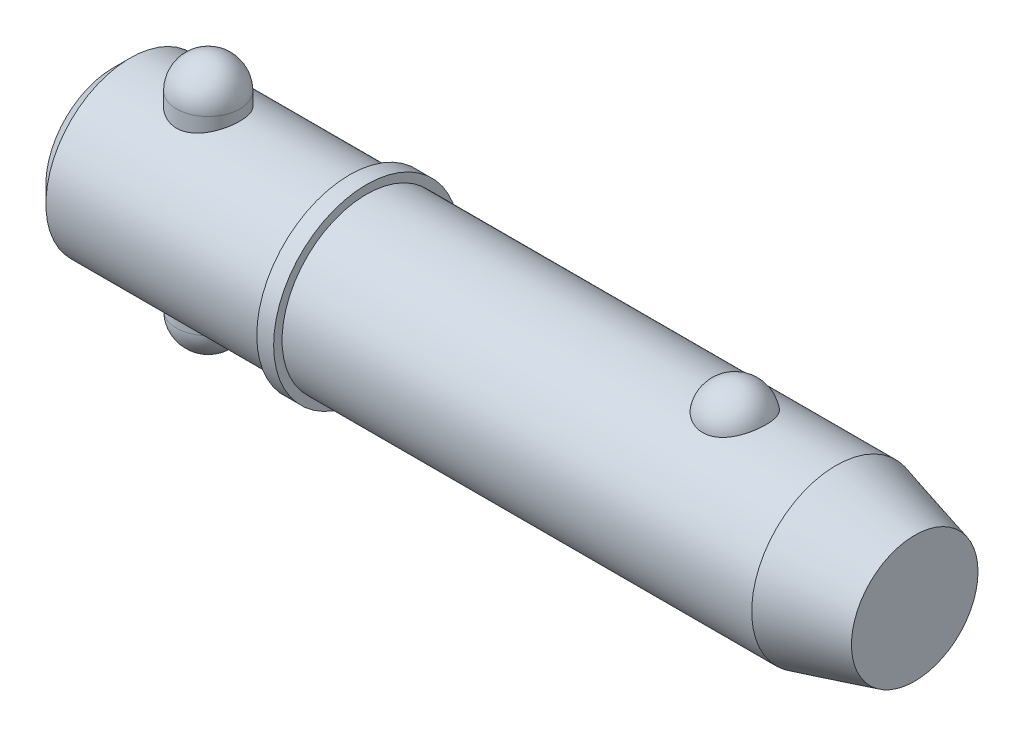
ISO-10303-21;
HEADER;
FILE_DESCRIPTION(('STEP AP214'),'2;1');
FILE_NAME('part.step','',(''),(''),'','','');
FILE_SCHEMA(('AUTOMOTIVE_DESIGN { 1 0 10303 214 1 1 1 1 }'));
ENDSEC;
DATA;
#1=APPLICATION_CONTEXT('core data for automotive mechanical design processes');
#2=APPLICATION_PROTOCOL_DEFINITION('international standard','automotive_design',2000,#1);
#3=PRODUCT_CONTEXT('',#1,'mechanical');
#4=PRODUCT('Part','Part','',(#3));
#5=PRODUCT_RELATED_PRODUCT_CATEGORY('part','',(#4));
#6=PRODUCT_DEFINITION_FORMATION('','',#4);
#7=PRODUCT_DEFINITION_CONTEXT('part definition',#1,'design');
#8=PRODUCT_DEFINITION('design','',#6,#7);
#9=PRODUCT_DEFINITION_SHAPE('','',#8);
#10=(LENGTH_UNIT() NAMED_UNIT(*) SI_UNIT(.MILLI.,.METRE.));
#11=(NAMED_UNIT(*) PLANE_ANGLE_UNIT() SI_UNIT($,.RADIAN.));
#12=(NAMED_UNIT(*) SI_UNIT($,.STERADIAN.) SOLID_ANGLE_UNIT());
#13=UNCERTAINTY_MEASURE_WITH_UNIT(LENGTH_MEASURE(1.E-05),#10,'distance_accuracy_value','');
#14=(GEOMETRIC_REPRESENTATION_CONTEXT(3) GLOBAL_UNCERTAINTY_ASSIGNED_CONTEXT((#13)) GLOBAL_UNIT_ASSIGNED_CONTEXT((#10,
#11,#12)) REPRESENTATION_CONTEXT('',''));
#15=CARTESIAN_POINT('',(0.,0.,0.));
#16=DIRECTION('',(0.,0.,1.));
#17=DIRECTION('',(1.,0.,0.));
#18=AXIS2_PLACEMENT_3D('',#15,#16,#17);
#19=CARTESIAN_POINT('',(14.28,19.05,0.));
#20=DIRECTION('',(0.,-1.,0.));
#21=DIRECTION('',(0.,0.,-1.));
#22=AXIS2_PLACEMENT_3D('',#19,#20,#21);
#23=CYLINDRICAL_SURFACE('',#22,4.76);
#24=CARTESIAN_POINT('',(14.28,-14.29,0.));
#25=DIRECTION('',(0.,-1.,0.));
#26=DIRECTION('',(0.,0.,-1.));
#27=AXIS2_PLACEMENT_3D('',#24,#25,#26);
#28=CIRCLE('',#27,4.76);
#29=CARTESIAN_POINT('',(14.28,-14.29,-4.76));
#30=VERTEX_POINT('',#29);
#31=EDGE_CURVE('P0_E10',#30,#30,#28,.F.);
#32=CARTESIAN_POINT('',(14.28,14.29,0.));
#33=DIRECTION('',(0.,-1.,0.));
#34=DIRECTION('',(0.,0.,-1.));
#35=AXIS2_PLACEMENT_3D('',#32,#33,#34);
#36=CIRCLE('',#35,4.76);
#37=CARTESIAN_POINT('',(14.28,14.29,-4.76));
#38=VERTEX_POINT('',#37);
#39=EDGE_CURVE('P0_E21',#38,#38,#36,.T.);
#40=CARTESIAN_POINT('',(14.28,-14.29,-4.76));
#41=CARTESIAN_POINT('',(14.28,-13.9922916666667,-4.76));
#42=CARTESIAN_POINT('',(14.28,-13.6945833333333,-4.76));
#43=CARTESIAN_POINT('',(14.28,-13.0991666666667,-4.76));
#44=CARTESIAN_POINT('',(14.28,-12.8014583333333,-4.76));
#45=CARTESIAN_POINT('',(14.28,-12.2060416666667,-4.76));
#46=CARTESIAN_POINT('',(14.28,-11.9083333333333,-4.76));
#47=CARTESIAN_POINT('',(14.28,-11.3129166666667,-4.76));
#48=CARTESIAN_POINT('',(14.28,-11.0152083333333,-4.76));
#49=CARTESIAN_POINT('',(14.28,-10.4197916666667,-4.76));
#50=CARTESIAN_POINT('',(14.28,-10.1220833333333,-4.76));
#51=CARTESIAN_POINT('',(14.28,-9.52666666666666,-4.76));
#52=CARTESIAN_POINT('',(14.28,-9.22895833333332,-4.76));
#53=CARTESIAN_POINT('',(14.28,-8.63354166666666,-4.76));
#54=CARTESIAN_POINT('',(14.28,-8.33583333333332,-4.76));
#55=CARTESIAN_POINT('',(14.28,-7.74041666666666,-4.76));
#56=CARTESIAN_POINT('',(14.28,-7.44270833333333,-4.76));
#57=CARTESIAN_POINT('',(14.28,-6.84729166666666,-4.76));
#58=CARTESIAN_POINT('',(14.28,-6.54958333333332,-4.76));
#59=CARTESIAN_POINT('',(14.28,-5.95416666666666,-4.76));
#60=CARTESIAN_POINT('',(14.28,-5.65645833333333,-4.76));
#61=CARTESIAN_POINT('',(14.28,-5.06104166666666,-4.76));
#62=CARTESIAN_POINT('',(14.28,-4.76333333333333,-4.76));
#63=CARTESIAN_POINT('',(14.28,-4.16791666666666,-4.76));
#64=CARTESIAN_POINT('',(14.28,-3.87020833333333,-4.76));
#65=CARTESIAN_POINT('',(14.28,-3.27479166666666,-4.76));
#66=CARTESIAN_POINT('',(14.28,-2.97708333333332,-4.76));
#67=CARTESIAN_POINT('',(14.28,-2.38166666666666,-4.76));
#68=CARTESIAN_POINT('',(14.28,-2.08395833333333,-4.76));
#69=CARTESIAN_POINT('',(14.28,-1.48854166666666,-4.76));
#70=CARTESIAN_POINT('',(14.28,-1.19083333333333,-4.76));
#71=CARTESIAN_POINT('',(14.28,-0.595416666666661,-4.76));
#72=CARTESIAN_POINT('',(14.28,-0.297708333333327,-4.76));
#73=CARTESIAN_POINT('',(14.28,0.297708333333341,-4.76));
#74=CARTESIAN_POINT('',(14.28,0.595416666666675,-4.76));
#75=CARTESIAN_POINT('',(14.28,1.19083333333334,-4.76));
#76=CARTESIAN_POINT('',(14.28,1.48854166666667,-4.76));
#77=CARTESIAN_POINT('',(14.28,2.08395833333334,-4.76));
#78=CARTESIAN_POINT('',(14.28,2.38166666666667,-4.76));
#79=CARTESIAN_POINT('',(14.28,2.97708333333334,-4.76));
#80=CARTESIAN_POINT('',(14.28,3.27479166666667,-4.76));
#81=CARTESIAN_POINT('',(14.28,3.87020833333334,-4.76));
#82=CARTESIAN_POINT('',(14.28,4.16791666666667,-4.76));
#83=CARTESIAN_POINT('',(14.28,4.76333333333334,-4.76));
#84=CARTESIAN_POINT('',(14.28,5.06104166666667,-4.76));
#85=CARTESIAN_POINT('',(14.28,5.65645833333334,-4.76));
#86=CARTESIAN_POINT('',(14.28,5.95416666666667,-4.76));
#87=CARTESIAN_POINT('',(14.28,6.54958333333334,-4.76));
#88=CARTESIAN_POINT('',(14.28,6.84729166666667,-4.76));
#89=CARTESIAN_POINT('',(14.28,7.44270833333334,-4.76));
#90=CARTESIAN_POINT('',(14.28,7.74041666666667,-4.76));
#91=CARTESIAN_POINT('',(14.28,8.33583333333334,-4.76));
#92=CARTESIAN_POINT('',(14.28,8.63354166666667,-4.76));
#93=CARTESIAN_POINT('',(14.28,9.22895833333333,-4.76));
#94=CARTESIAN_POINT('',(14.28,9.52666666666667,-4.76));
#95=CARTESIAN_POINT('',(14.28,10.1220833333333,-4.76));
#96=CARTESIAN_POINT('',(14.28,10.4197916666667,-4.76));
#97=CARTESIAN_POINT('',(14.28,11.0152083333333,-4.76));
#98=CARTESIAN_POINT('',(14.28,11.3129166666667,-4.76));
#99=CARTESIAN_POINT('',(14.28,11.9083333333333,-4.76));
#100=CARTESIAN_POINT('',(14.28,12.2060416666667,-4.76));
#101=CARTESIAN_POINT('',(14.28,12.8014583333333,-4.76));
#102=CARTESIAN_POINT('',(14.28,13.0991666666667,-4.76));
#103=CARTESIAN_POINT('',(14.28,13.6945833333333,-4.76));
#104=CARTESIAN_POINT('',(14.28,13.9922916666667,-4.76));
#105=CARTESIAN_POINT('',(14.28,14.29,-4.76));
#106=B_SPLINE_CURVE_WITH_KNOTS('',3,(#40,#41,#42,#43,#44,#45,#46,#47,#48,#49,#50,#51,#52,#53,
#54,#55,#56,#57,#58,#59,#60,#61,#62,#63,#64,#65,#66,#67,#68,#69,#70,#71,#72,#73,#74,#75,#76,#77,
#78,#79,#80,#81,#82,#83,#84,#85,#86,#87,#88,#89,#90,#91,#92,#93,#94,#95,#96,#97,#98,#99,#100,
#101,#102,#103,#104,#105),.UNSPECIFIED.,.F.,.F.,(4,2,2,2,2,2,2,2,2,2,2,2,2,2,2,2,2,2,2,2,2,2,2,
2,2,2,2,2,2,2,2,2,4),(0.,0.893125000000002,1.78625,2.67937499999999,3.5725,4.465625,5.35875,
6.25187499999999,7.145,8.038125,8.93125,9.82437499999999,10.7175,11.610625,12.50375,13.396875,
14.29,15.183125,16.07625,16.969375,17.8625,18.755625,19.64875,20.541875,21.435,22.328125,
23.22125,24.114375,25.0075,25.900625,26.79375,27.686875,28.58),.UNSPECIFIED.);
#107=EDGE_CURVE('P0_BSEAM14',#30,#38,#106,.T.);
#108=ORIENTED_EDGE('',*,*,#31,.T.);
#109=ORIENTED_EDGE('',*,*,#39,.T.);
#110=ORIENTED_EDGE('',*,*,#107,.T.);
#111=ORIENTED_EDGE('',*,*,#107,.F.);
#112=EDGE_LOOP('',(#108,#110,#109,#111));
#113=FACE_BOUND('',#112,.T.);
#114=ADVANCED_FACE('P0_F14',(#113),#23,.T.);
#115=CARTESIAN_POINT('',(14.28,-14.29,0.));
#116=DIRECTION('',(0.,0.,1.));
#117=DIRECTION('',(1.,0.,0.));
#118=AXIS2_PLACEMENT_3D('',#115,#116,#117);
#119=SPHERICAL_SURFACE('',#118,4.76);
#120=CARTESIAN_POINT('',(14.28,-14.29,0.));
#121=DIRECTION('',(0.,-1.,0.));
#122=DIRECTION('',(0.,0.,-1.));
#123=AXIS2_PLACEMENT_3D('',#120,#121,#122);
#124=SPHERICAL_SURFACE('',#123,4.76);
#125=ORIENTED_EDGE('',*,*,#31,.F.);
#126=EDGE_LOOP('',(#125));
#127=FACE_BOUND('',#126,.T.);
#128=ADVANCED_FACE('P0_F29',(#127),#124,.T.);
#129=CARTESIAN_POINT('',(14.28,14.29,0.));
#130=DIRECTION('',(0.,0.,1.));
#131=DIRECTION('',(1.,0.,0.));
#132=AXIS2_PLACEMENT_3D('',#129,#130,#131);
#133=SPHERICAL_SURFACE('',#132,4.76);
#134=CARTESIAN_POINT('',(14.28,14.29,0.));
#135=DIRECTION('',(0.,-1.,0.));
#136=DIRECTION('',(0.,0.,-1.));
#137=AXIS2_PLACEMENT_3D('',#134,#135,#136);
#138=SPHERICAL_SURFACE('',#137,4.76);
#139=ORIENTED_EDGE('',*,*,#39,.F.);
#140=EDGE_LOOP('',(#139));
#141=FACE_BOUND('',#140,.T.);
#142=ADVANCED_FACE('P0_F16',(#141),#138,.T.);
#143=CLOSED_SHELL('',(#114,#128,#142));
#144=MANIFOLD_SOLID_BREP('P0_B1',#143);
#145=CARTESIAN_POINT('',(0.,0.,0.));
#146=DIRECTION('',(1.,0.,0.));
#147=DIRECTION('',(0.,0.,-1.));
#148=AXIS2_PLACEMENT_3D('',#145,#146,#147);
#149=CYLINDRICAL_SURFACE('',#148,12.7);
#150=CARTESIAN_POINT('',(108.800738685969,0.,0.));
#151=DIRECTION('',(1.,0.,0.));
#152=DIRECTION('',(0.,0.,-1.));
#153=AXIS2_PLACEMENT_3D('',#150,#151,#152);
#154=CIRCLE('',#153,12.7);
#155=CARTESIAN_POINT('',(108.800738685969,0.,-12.7));
#156=VERTEX_POINT('',#155);
#157=EDGE_CURVE('P1_E81',#156,#156,#154,.T.);
#158=ORIENTED_EDGE('',*,*,#157,.F.);
#159=EDGE_LOOP('',(#158));
#160=FACE_BOUND('',#159,.T.);
#161=CARTESIAN_POINT('',(38.1,0.,0.));
#162=DIRECTION('',(1.,0.,0.));
#163=DIRECTION('',(0.,0.,-1.));
#164=AXIS2_PLACEMENT_3D('',#161,#162,#163);
#165=CIRCLE('',#164,12.7);
#166=CARTESIAN_POINT('',(38.1,0.,-12.7));
#167=VERTEX_POINT('',#166);
#168=EDGE_CURVE('P1_E85',#167,#167,#165,.T.);
#169=ORIENTED_EDGE('',*,*,#168,.T.);
#170=EDGE_LOOP('',(#169));
#171=FACE_BOUND('',#170,.T.);
#172=CARTESIAN_POINT('',(93.5600429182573,11.7500437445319,4.81938502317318));
#173=CARTESIAN_POINT('',(93.4350881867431,11.7500430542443,4.81938571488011));
#174=CARTESIAN_POINT('',(93.310144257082,11.7520975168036,4.81438658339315));
#175=CARTESIAN_POINT('',(93.0611425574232,11.760253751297,4.79442904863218));
#176=CARTESIAN_POINT('',(92.9370850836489,11.7663568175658,4.77946746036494));
#177=CARTESIAN_POINT('',(92.6909016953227,11.7824262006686,4.7397141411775));
#178=CARTESIAN_POINT('',(92.5687744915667,11.7923898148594,4.71492928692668));
#179=CARTESIAN_POINT('',(92.3271874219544,11.8158938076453,4.65571340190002));
#180=CARTESIAN_POINT('',(92.2077285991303,11.8294355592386,4.6212786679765));
#181=CARTESIAN_POINT('',(91.9725578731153,11.8596812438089,4.54309502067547));
#182=CARTESIAN_POINT('',(91.8568393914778,11.8763792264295,4.49936361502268));
#183=CARTESIAN_POINT('',(91.6296530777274,11.9124878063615,4.40287235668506));
#184=CARTESIAN_POINT('',(91.5181868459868,11.9318994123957,4.35010914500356));
#185=CARTESIAN_POINT('',(91.1912782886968,11.9934256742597,4.17881316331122));
#186=CARTESIAN_POINT('',(90.9831270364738,12.038858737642,4.04720756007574));
#187=CARTESIAN_POINT('',(90.5858509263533,12.1352173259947,3.748564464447));
#188=CARTESIAN_POINT('',(90.3974438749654,12.1862630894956,3.58061821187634));
#189=CARTESIAN_POINT('',(90.0505213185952,12.2875163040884,3.21600758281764));
#190=CARTESIAN_POINT('',(89.8920113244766,12.3377235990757,3.0193379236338));
#191=CARTESIAN_POINT('',(89.6016887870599,12.434492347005,2.592916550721));
#192=CARTESIAN_POINT('',(89.4713762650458,12.4807925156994,2.36208286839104));
#193=CARTESIAN_POINT('',(89.2494079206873,12.5623454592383,1.88070399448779));
#194=CARTESIAN_POINT('',(89.1577554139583,12.5975972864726,1.63015711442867));
#195=CARTESIAN_POINT('',(89.0140466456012,12.6538414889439,1.1129886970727));
#196=CARTESIAN_POINT('',(88.9624990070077,12.6746503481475,0.846205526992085));
#197=CARTESIAN_POINT('',(88.9019771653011,12.699153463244,0.307085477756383));
#198=CARTESIAN_POINT('',(88.8930018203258,12.7028481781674,0.0347487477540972));
#199=CARTESIAN_POINT('',(88.9177310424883,12.6927785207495,-0.506073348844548));
#200=CARTESIAN_POINT('',(88.9511899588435,12.6791146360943,-0.77457186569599));
#201=CARTESIAN_POINT('',(89.0596877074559,12.635882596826,-1.30170246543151));
#202=CARTESIAN_POINT('',(89.1347272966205,12.606314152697,-1.5603343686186));
#203=CARTESIAN_POINT('',(89.3250000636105,12.5342328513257,-2.06083899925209));
#204=CARTESIAN_POINT('',(89.4402872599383,12.4917026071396,-2.3026886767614));
#205=CARTESIAN_POINT('',(89.7087044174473,12.3981123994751,-2.76259600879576));
#206=CARTESIAN_POINT('',(89.8618374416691,12.3470517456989,-2.98065173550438));
#207=CARTESIAN_POINT('',(90.2035077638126,12.2416045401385,-3.38786328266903));
#208=CARTESIAN_POINT('',(90.3922017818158,12.1872040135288,-3.57688418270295));
#209=CARTESIAN_POINT('',(90.8002392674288,12.0814086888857,-3.91941073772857));
#210=CARTESIAN_POINT('',(91.0195800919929,12.0300136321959,-4.07291945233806));
#211=CARTESIAN_POINT('',(91.4783753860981,11.9373542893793,-4.33691289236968));
#212=CARTESIAN_POINT('',(91.7173044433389,11.8958982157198,-4.44824125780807));
#213=CARTESIAN_POINT('',(92.2124376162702,11.8268116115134,-4.62881985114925));
#214=CARTESIAN_POINT('',(92.4686351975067,11.7991758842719,-4.69808589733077));
#215=CARTESIAN_POINT('',(92.9771640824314,11.7622209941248,-4.78983181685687));
#216=CARTESIAN_POINT('',(93.2290414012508,11.7520502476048,-4.81449025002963));
#217=CARTESIAN_POINT('',(93.7335734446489,11.7485796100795,-4.82295735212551));
#218=CARTESIAN_POINT('',(93.9862280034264,11.7552763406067,-4.80677420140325));
#219=CARTESIAN_POINT('',(94.4768341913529,11.7842584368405,-4.73525430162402));
#220=CARTESIAN_POINT('',(94.7149984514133,11.8060486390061,-4.68116061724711));
#221=CARTESIAN_POINT('',(95.1784894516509,11.8622750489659,-4.53678133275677));
#222=CARTESIAN_POINT('',(95.4038151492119,11.8967122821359,-4.44649279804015));
#223=CARTESIAN_POINT('',(95.8408018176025,11.9754603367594,-4.2298761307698));
#224=CARTESIAN_POINT('',(96.0520579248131,12.0199699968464,-4.10280539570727));
#225=CARTESIAN_POINT('',(96.4506012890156,12.1138028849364,-3.81685409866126));
#226=CARTESIAN_POINT('',(96.6378830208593,12.163127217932,-3.65796622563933));
#227=CARTESIAN_POINT('',(96.9933509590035,12.2642343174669,-3.30364864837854));
#228=CARTESIAN_POINT('',(97.1601119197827,12.3160165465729,-3.10678783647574));
#229=CARTESIAN_POINT('',(97.4595799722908,12.4142566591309,-2.68748409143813));
#230=CARTESIAN_POINT('',(97.5922809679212,12.4607135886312,-2.46503658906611));
#231=CARTESIAN_POINT('',(97.8246912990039,12.5450236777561,-1.99289519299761));
#232=CARTESIAN_POINT('',(97.923215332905,12.5825557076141,-1.74255918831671));
#233=CARTESIAN_POINT('',(98.0792277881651,12.6431720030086,-1.22773734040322));
#234=CARTESIAN_POINT('',(98.1367157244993,12.6662560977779,-0.963251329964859));
#235=CARTESIAN_POINT('',(98.2095441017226,12.6956486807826,-0.427355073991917));
#236=CARTESIAN_POINT('',(98.2248378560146,12.7019385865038,-0.1559374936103));
#237=CARTESIAN_POINT('',(98.2127794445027,12.6970201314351,0.385928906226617));
#238=CARTESIAN_POINT('',(98.1854280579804,12.6858120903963,0.656377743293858));
#239=CARTESIAN_POINT('',(98.1130609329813,12.6568455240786,1.05454017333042));
#240=CARTESIAN_POINT('',(98.0837963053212,12.6451962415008,1.18577850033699));
#241=CARTESIAN_POINT('',(98.0150228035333,12.6181819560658,1.4451380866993));
#242=CARTESIAN_POINT('',(97.9755176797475,12.6028183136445,1.57326046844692));
#243=CARTESIAN_POINT('',(97.8864397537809,12.5687547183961,1.82554978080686));
#244=CARTESIAN_POINT('',(97.8368627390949,12.5500533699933,1.9497150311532));
#245=CARTESIAN_POINT('',(97.7279211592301,12.5098093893,2.1931437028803));
#246=CARTESIAN_POINT('',(97.6685601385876,12.4882677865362,2.31240887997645));
#247=CARTESIAN_POINT('',(97.5399712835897,12.4427679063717,2.54593031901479));
#248=CARTESIAN_POINT('',(97.4706888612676,12.4187964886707,2.66015396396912));
#249=CARTESIAN_POINT('',(97.322903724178,12.3691892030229,2.88202659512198));
#250=CARTESIAN_POINT('',(97.2444044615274,12.3435539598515,2.98967802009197));
#251=CARTESIAN_POINT('',(97.0785502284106,12.2912955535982,3.19774385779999));
#252=CARTESIAN_POINT('',(96.9911918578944,12.2646720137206,3.29815546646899));
#253=CARTESIAN_POINT('',(96.8081617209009,12.2111945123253,3.49095035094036));
#254=CARTESIAN_POINT('',(96.7124932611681,12.1843406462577,3.58333679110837));
#255=CARTESIAN_POINT('',(96.5136272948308,12.1312249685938,3.75922876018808));
#256=CARTESIAN_POINT('',(96.4104503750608,12.104961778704,3.84275713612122));
#257=CARTESIAN_POINT('',(96.1970133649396,12.0537284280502,4.00056406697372));
#258=CARTESIAN_POINT('',(96.0867562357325,12.028757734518,4.07484645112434));
#259=CARTESIAN_POINT('',(95.8597550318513,11.9808306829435,4.21367959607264));
#260=CARTESIAN_POINT('',(95.7430068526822,11.9578756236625,4.27822410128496));
#261=CARTESIAN_POINT('',(95.5039425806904,11.9147184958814,4.39698483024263));
#262=CARTESIAN_POINT('',(95.3816287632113,11.894515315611,4.45120522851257));
#263=CARTESIAN_POINT('',(95.122952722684,11.8561129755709,4.55255353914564));
#264=CARTESIAN_POINT('',(94.9862237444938,11.8381764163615,4.59884858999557));
#265=CARTESIAN_POINT('',(94.7086087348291,11.8069093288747,4.67853897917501));
#266=CARTESIAN_POINT('',(94.5677245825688,11.7935767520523,4.71194005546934));
#267=CARTESIAN_POINT('',(94.2830944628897,11.7720277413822,4.76552188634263));
#268=CARTESIAN_POINT('',(94.1393488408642,11.7638106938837,4.78570422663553));
#269=CARTESIAN_POINT('',(93.8504114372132,11.7528195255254,4.81263433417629));
#270=CARTESIAN_POINT('',(93.7052198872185,11.7500445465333,4.81938421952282));
#271=CARTESIAN_POINT('',(93.5600429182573,11.7500437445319,4.81938502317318));
#272=B_SPLINE_CURVE_WITH_KNOTS('',3,(#172,#173,#174,#175,#176,#177,#178,#179,#180,#181,#182,
#183,#184,#185,#186,#187,#188,#189,#190,#191,#192,#193,#194,#195,#196,#197,#198,#199,#200,#201,
#202,#203,#204,#205,#206,#207,#208,#209,#210,#211,#212,#213,#214,#215,#216,#217,#218,#219,#220,
#221,#222,#223,#224,#225,#226,#227,#228,#229,#230,#231,#232,#233,#234,#235,#236,#237,#238,#239,
#240,#241,#242,#243,#244,#245,#246,#247,#248,#249,#250,#251,#252,#253,#254,#255,#256,#257,#258,
#259,#260,#261,#262,#263,#264,#265,#266,#267,#268,#269,#270,#271),.UNSPECIFIED.,.T.,.F.,(4,2,2,
2,2,2,2,2,2,2,2,2,2,2,2,2,2,2,2,2,2,2,2,2,2,2,2,2,2,2,2,2,2,2,2,2,2,2,2,2,2,2,2,2,2,2,2,2,2,4),
(0.,0.374729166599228,0.749578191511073,1.12416526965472,1.49889629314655,1.87292776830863,
2.24709865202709,2.99481328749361,3.76399449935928,4.53331735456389,5.3368391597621,
6.14042986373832,6.95405296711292,7.76765424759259,8.57656703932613,9.38549455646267,
10.1955119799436,11.0055949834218,11.8193353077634,12.6330054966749,13.4294141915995,
14.2255231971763,14.9815786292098,15.7374826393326,16.4696948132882,17.2019663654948,
17.9501979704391,18.6986017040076,19.484470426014,20.2704797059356,21.0815215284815,
21.8925729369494,22.7045213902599,23.5164550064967,23.9209608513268,24.3253187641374,
24.7298461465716,25.1342272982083,25.54092555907,25.9474719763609,26.3541750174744,
26.7607169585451,27.1661834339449,27.5714814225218,27.9770386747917,28.3824315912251,
28.8181206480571,29.2536155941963,29.6890582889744,30.1244323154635),.UNSPECIFIED.);
#273=CARTESIAN_POINT('',(93.5600429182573,11.7500437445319,4.81938502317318));
#274=VERTEX_POINT('',#273);
#275=EDGE_CURVE('P1_E35',#274,#274,#272,.T.);
#276=ORIENTED_EDGE('',*,*,#275,.T.);
#277=EDGE_LOOP('',(#276));
#278=FACE_BOUND('',#277,.T.);
#279=ADVANCED_FACE('P1_F13',(#160,#171,#278),#149,.T.);
#280=CARTESIAN_POINT('',(0.,0.,0.));
#281=DIRECTION('',(-1.,0.,0.));
#282=DIRECTION('',(0.,0.,1.));
#283=AXIS2_PLACEMENT_3D('',#280,#281,#282);
#284=PLANE('',#283);
#285=CARTESIAN_POINT('',(0.,0.,0.));
#286=DIRECTION('',(1.,0.,0.));
#287=DIRECTION('',(0.,0.,-1.));
#288=AXIS2_PLACEMENT_3D('',#285,#286,#287);
#289=CIRCLE('',#288,10.16);
#290=CARTESIAN_POINT('',(0.,0.,-10.16));
#291=VERTEX_POINT('',#290);
#292=EDGE_CURVE('P1_E9',#291,#291,#289,.T.);
#293=ORIENTED_EDGE('',*,*,#292,.F.);
#294=EDGE_LOOP('',(#293));
#295=FACE_BOUND('',#294,.T.);
#296=ADVANCED_FACE('P1_F15',(#295),#284,.T.);
#297=CARTESIAN_POINT('',(2.53999999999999,0.,0.));
#298=DIRECTION('',(1.,0.,0.));
#299=DIRECTION('',(0.,0.,-1.));
#300=AXIS2_PLACEMENT_3D('',#297,#298,#299);
#301=CONICAL_SURFACE('',#300,12.7,0.78539816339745);
#302=ORIENTED_EDGE('',*,*,#292,.T.);
#303=EDGE_LOOP('',(#302));
#304=FACE_BOUND('',#303,.T.);
#305=CARTESIAN_POINT('',(2.53999999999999,0.,0.));
#306=DIRECTION('',(1.,0.,0.));
#307=DIRECTION('',(0.,0.,-1.));
#308=AXIS2_PLACEMENT_3D('',#305,#306,#307);
#309=CIRCLE('',#308,12.7);
#310=CARTESIAN_POINT('',(2.53999999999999,0.,-12.7));
#311=VERTEX_POINT('',#310);
#312=EDGE_CURVE('P1_E26',#311,#311,#309,.T.);
#313=ORIENTED_EDGE('',*,*,#312,.F.);
#314=EDGE_LOOP('',(#313));
#315=FACE_BOUND('',#314,.T.);
#316=ADVANCED_FACE('P1_F77',(#304,#315),#301,.T.);
#317=CARTESIAN_POINT('',(0.,0.,0.));
#318=DIRECTION('',(1.,0.,0.));
#319=DIRECTION('',(0.,0.,-1.));
#320=AXIS2_PLACEMENT_3D('',#317,#318,#319);
#321=CYLINDRICAL_SURFACE('',#320,12.7);
#322=CARTESIAN_POINT('',(14.28,-11.7742260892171,4.76));
#323=CARTESIAN_POINT('',(14.1514948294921,-11.7742255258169,4.76000061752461));
#324=CARTESIAN_POINT('',(14.0229980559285,-11.7763355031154,4.75479194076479));
#325=CARTESIAN_POINT('',(13.7669369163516,-11.7847043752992,4.73401198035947));
#326=CARTESIAN_POINT('',(13.6393728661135,-11.7909646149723,4.71843733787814));
#327=CARTESIAN_POINT('',(13.386226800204,-11.8074248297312,4.67709434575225));
#328=CARTESIAN_POINT('',(13.2606439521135,-11.8176231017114,4.65133040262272));
#329=CARTESIAN_POINT('',(13.0122434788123,-11.8416347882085,4.58985545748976));
#330=CARTESIAN_POINT('',(12.8894269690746,-11.8554496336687,4.55414051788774));
#331=CARTESIAN_POINT('',(12.6477622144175,-11.8862222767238,4.47320764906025));
#332=CARTESIAN_POINT('',(12.5289037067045,-11.9031710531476,4.4280169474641));
#333=CARTESIAN_POINT('',(12.2955059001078,-11.939736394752,4.32845291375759));
#334=CARTESIAN_POINT('',(12.1809682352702,-11.9593539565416,4.2740761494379));
#335=CARTESIAN_POINT('',(11.8448901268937,-12.0213893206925,4.09777237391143));
#336=CARTESIAN_POINT('',(11.6307077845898,-12.0670135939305,3.9626122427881));
#337=CARTESIAN_POINT('',(11.2179129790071,-12.1641514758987,3.65386230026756));
#338=CARTESIAN_POINT('',(11.0204399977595,-12.2158379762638,3.47881300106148));
#339=CARTESIAN_POINT('',(10.6568212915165,-12.3178468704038,3.09829182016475));
#340=CARTESIAN_POINT('',(10.4906822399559,-12.3681689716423,2.89281347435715));
#341=CARTESIAN_POINT('',(10.1890299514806,-12.4638367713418,2.44867909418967));
#342=CARTESIAN_POINT('',(10.054749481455,-12.5089552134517,2.20913281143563));
#343=CARTESIAN_POINT('',(9.82886079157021,-12.5870472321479,1.70885919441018));
#344=CARTESIAN_POINT('',(9.73723778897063,-12.620025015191,1.44813923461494));
#345=CARTESIAN_POINT('',(9.60324488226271,-12.6688874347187,0.9248423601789));
#346=CARTESIAN_POINT('',(9.55892269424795,-12.6854474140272,0.662829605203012));
#347=CARTESIAN_POINT('',(9.5145335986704,-12.7020320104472,0.134596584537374));
#348=CARTESIAN_POINT('',(9.5144523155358,-12.7020619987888,-0.131622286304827));
#349=CARTESIAN_POINT('',(9.55741019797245,-12.6860129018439,-0.646717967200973));
#350=CARTESIAN_POINT('',(9.59831845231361,-12.6707298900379,-0.895801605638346));
#351=CARTESIAN_POINT('',(9.71850987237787,-12.6268158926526,-1.38327219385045));
#352=CARTESIAN_POINT('',(9.79779575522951,-12.5981839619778,-1.62165838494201));
#353=CARTESIAN_POINT('',(9.99348296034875,-12.5298894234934,-2.08508424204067));
#354=CARTESIAN_POINT('',(10.110407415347,-12.4900724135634,-2.30987931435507));
#355=CARTESIAN_POINT('',(10.3775896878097,-12.4034373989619,-2.7372158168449));
#356=CARTESIAN_POINT('',(10.5278582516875,-12.3566171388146,-2.93975004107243));
#357=CARTESIAN_POINT('',(10.8677318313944,-12.257571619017,-3.32936830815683));
#358=CARTESIAN_POINT('',(11.0591227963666,-12.2051903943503,-3.51485714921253));
#359=CARTESIAN_POINT('',(11.4706087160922,-12.1031155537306,-3.85170663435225));
#360=CARTESIAN_POINT('',(11.6907108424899,-12.0534226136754,-4.00305872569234));
#361=CARTESIAN_POINT('',(12.1596597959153,-11.9613684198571,-4.27038218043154));
#362=CARTESIAN_POINT('',(12.4090353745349,-11.9191939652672,-4.38549550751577));
#363=CARTESIAN_POINT('',(12.9256290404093,-11.8491124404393,-4.57149117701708));
#364=CARTESIAN_POINT('',(13.1928371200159,-11.8211974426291,-4.64239810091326));
#365=CARTESIAN_POINT('',(13.7217488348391,-11.7846654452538,-4.73434137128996));
#366=CARTESIAN_POINT('',(13.9829438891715,-11.7750694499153,-4.75791141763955));
#367=CARTESIAN_POINT('',(14.5056760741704,-11.7734909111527,-4.76182097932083));
#368=CARTESIAN_POINT('',(14.7672131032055,-11.7815039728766,-4.74217128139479));
#369=CARTESIAN_POINT('',(15.2702140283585,-11.8132466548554,-4.66249544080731));
#370=CARTESIAN_POINT('',(15.5120417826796,-11.8362133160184,-4.60442726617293));
#371=CARTESIAN_POINT('',(15.9824097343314,-11.8943704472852,-4.45202868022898));
#372=CARTESIAN_POINT('',(16.2109472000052,-11.9295634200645,-4.35769084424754));
#373=CARTESIAN_POINT('',(16.6577741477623,-12.0098310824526,-4.13144368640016));
#374=CARTESIAN_POINT('',(16.8753590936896,-12.055226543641,-3.99825937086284));
#375=CARTESIAN_POINT('',(17.2859732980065,-12.150238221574,-3.69949845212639));
#376=CARTESIAN_POINT('',(17.4789935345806,-12.19985597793,-3.5339100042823));
#377=CARTESIAN_POINT('',(17.8477707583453,-12.3015434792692,-3.1624728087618));
#378=CARTESIAN_POINT('',(18.0216609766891,-12.3535695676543,-2.95473880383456));
#379=CARTESIAN_POINT('',(18.254545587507,-12.426745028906,-2.62277433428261));
#380=CARTESIAN_POINT('',(18.3275489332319,-12.4503382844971,-2.50865480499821));
#381=CARTESIAN_POINT('',(18.463723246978,-12.4952713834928,-2.27428971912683));
#382=CARTESIAN_POINT('',(18.5268984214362,-12.5166121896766,-2.15404681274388));
#383=CARTESIAN_POINT('',(18.6427140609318,-12.5563817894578,-1.90858448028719));
#384=CARTESIAN_POINT('',(18.6953855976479,-12.5748191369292,-1.78338108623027));
#385=CARTESIAN_POINT('',(18.7899337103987,-12.6083284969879,-1.52857834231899));
#386=CARTESIAN_POINT('',(18.8318147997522,-12.6234019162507,-1.39898085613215));
#387=CARTESIAN_POINT('',(18.9043819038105,-12.6497495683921,-1.13633254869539));
#388=CARTESIAN_POINT('',(18.9350698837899,-12.6610244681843,-1.00328233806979));
#389=CARTESIAN_POINT('',(18.9849303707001,-12.6794412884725,-0.734761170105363));
#390=CARTESIAN_POINT('',(19.0041035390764,-12.6865834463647,-0.59929035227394));
#391=CARTESIAN_POINT('',(19.0299427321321,-12.6962286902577,-0.335006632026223));
#392=CARTESIAN_POINT('',(19.0372742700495,-12.698978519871,-0.206267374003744));
#393=CARTESIAN_POINT('',(19.0414668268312,-12.7005496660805,0.0514515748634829));
#394=CARTESIAN_POINT('',(19.038324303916,-12.69936965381,0.180431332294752));
#395=CARTESIAN_POINT('',(19.0215965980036,-12.6931114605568,0.437551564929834));
#396=CARTESIAN_POINT('',(19.0080165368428,-12.6880351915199,0.565692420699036));
#397=CARTESIAN_POINT('',(18.9705519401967,-12.6741222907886,0.820297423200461));
#398=CARTESIAN_POINT('',(18.9466635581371,-12.665284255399,0.946760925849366));
#399=CARTESIAN_POINT('',(18.8895279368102,-12.6443449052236,1.19395899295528));
#400=CARTESIAN_POINT('',(18.8565273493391,-12.6323299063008,1.3147578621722));
#401=CARTESIAN_POINT('',(18.781239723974,-12.6052503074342,1.55308888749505));
#402=CARTESIAN_POINT('',(18.738949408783,-12.5901846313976,1.67061987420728));
#403=CARTESIAN_POINT('',(18.5986461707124,-12.5409473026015,2.01714406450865));
#404=CARTESIAN_POINT('',(18.4871532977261,-12.502717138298,2.24027279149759));
#405=CARTESIAN_POINT('',(18.2262440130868,-12.4173042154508,2.6742599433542));
#406=CARTESIAN_POINT('',(18.0754310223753,-12.3698127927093,2.88420891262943));
#407=CARTESIAN_POINT('',(17.7421836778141,-12.271667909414,3.27675114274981));
#408=CARTESIAN_POINT('',(17.5597380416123,-12.2210133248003,3.45933459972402));
#409=CARTESIAN_POINT('',(17.2605468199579,-12.1452079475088,3.7138066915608));
#410=CARTESIAN_POINT('',(17.1535518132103,-12.119328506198,3.79719993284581));
#411=CARTESIAN_POINT('',(16.9326449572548,-12.0688597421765,3.95467398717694));
#412=CARTESIAN_POINT('',(16.8187356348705,-12.0442699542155,4.02875817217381));
#413=CARTESIAN_POINT('',(16.5846234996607,-11.9971053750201,4.16711104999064));
#414=CARTESIAN_POINT('',(16.4644172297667,-11.9745317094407,4.23137427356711));
#415=CARTESIAN_POINT('',(16.2185866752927,-11.9321360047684,4.34949041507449));
#416=CARTESIAN_POINT('',(16.09296473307,-11.9123127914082,4.40334777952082));
#417=CARTESIAN_POINT('',(15.8314769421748,-11.875268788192,4.50232278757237));
#418=CARTESIAN_POINT('',(15.6954035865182,-11.8582009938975,4.54695127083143));
#419=CARTESIAN_POINT('',(15.4194002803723,-11.8284328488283,4.62383807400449));
#420=CARTESIAN_POINT('',(15.2794720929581,-11.815730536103,4.6561019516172));
#421=CARTESIAN_POINT('',(14.9969657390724,-11.7951940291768,4.70788444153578));
#422=CARTESIAN_POINT('',(14.8543884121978,-11.7873583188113,4.72740702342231));
#423=CARTESIAN_POINT('',(14.5678704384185,-11.7768749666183,4.75346370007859));
#424=CARTESIAN_POINT('',(14.4239299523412,-11.7742267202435,4.75999930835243));
#425=CARTESIAN_POINT('',(14.28,-11.7742260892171,4.76));
#426=B_SPLINE_CURVE_WITH_KNOTS('',3,(#322,#323,#324,#325,#326,#327,#328,#329,#330,#331,#332,
#333,#334,#335,#336,#337,#338,#339,#340,#341,#342,#343,#344,#345,#346,#347,#348,#349,#350,#351,
#352,#353,#354,#355,#356,#357,#358,#359,#360,#361,#362,#363,#364,#365,#366,#367,#368,#369,#370,
#371,#372,#373,#374,#375,#376,#377,#378,#379,#380,#381,#382,#383,#384,#385,#386,#387,#388,#389,
#390,#391,#392,#393,#394,#395,#396,#397,#398,#399,#400,#401,#402,#403,#404,#405,#406,#407,#408,
#409,#410,#411,#412,#413,#414,#415,#416,#417,#418,#419,#420,#421,#422,#423,#424,#425),
.UNSPECIFIED.,.T.,.F.,(4,2,2,2,2,2,2,2,2,2,2,2,2,2,2,2,2,2,2,2,2,2,2,2,2,2,2,2,2,2,2,2,2,2,2,2,
2,2,2,2,2,2,2,2,2,2,2,2,2,2,2,4),(0.,0.385378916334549,0.770882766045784,1.15622008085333,
1.54171009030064,1.92610725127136,2.31064835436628,3.07917291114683,3.88239385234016,
4.68578566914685,5.51648193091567,6.34689010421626,7.14151420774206,7.93588010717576,
8.69098665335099,9.44614666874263,10.2122918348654,10.9786842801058,11.789876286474,
12.6012713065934,13.4306405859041,14.2595482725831,15.0427613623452,15.8257790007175,
16.5716820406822,17.3177378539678,18.0917395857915,18.8660247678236,19.6893332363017,
20.1014571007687,20.5134040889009,20.9241137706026,21.3346513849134,21.7451168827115,
22.1555587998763,22.542011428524,22.928594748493,23.3149884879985,23.7015265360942,
24.0784835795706,24.4555738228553,25.2091300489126,25.994347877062,26.7798463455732,
27.1937428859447,27.6074890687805,28.0214648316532,28.4352633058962,28.8672794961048,
29.299101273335,29.7307884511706,30.1624253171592),.UNSPECIFIED.);
#427=CARTESIAN_POINT('',(14.28,-11.7742260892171,4.76));
#428=VERTEX_POINT('',#427);
#429=EDGE_CURVE('P1_E17',#428,#428,#426,.T.);
#430=ORIENTED_EDGE('',*,*,#429,.F.);
#431=EDGE_LOOP('',(#430));
#432=FACE_BOUND('',#431,.T.);
#433=CARTESIAN_POINT('',(14.28,11.7742260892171,4.76));
#434=CARTESIAN_POINT('',(14.4085051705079,11.7742255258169,4.76000061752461));
#435=CARTESIAN_POINT('',(14.5370019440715,11.7763355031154,4.75479194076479));
#436=CARTESIAN_POINT('',(14.7930630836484,11.7847043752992,4.73401198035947));
#437=CARTESIAN_POINT('',(14.9206271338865,11.7909646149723,4.71843733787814));
#438=CARTESIAN_POINT('',(15.173773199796,11.8074248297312,4.67709434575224));
#439=CARTESIAN_POINT('',(15.2993560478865,11.8176231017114,4.65133040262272));
#440=CARTESIAN_POINT('',(15.5477565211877,11.8416347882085,4.58985545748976));
#441=CARTESIAN_POINT('',(15.6705730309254,11.8554496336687,4.55414051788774));
#442=CARTESIAN_POINT('',(15.9122377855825,11.8862222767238,4.47320764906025));
#443=CARTESIAN_POINT('',(16.0310962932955,11.9031710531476,4.4280169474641));
#444=CARTESIAN_POINT('',(16.2644940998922,11.939736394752,4.32845291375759));
#445=CARTESIAN_POINT('',(16.3790317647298,11.9593539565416,4.2740761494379));
#446=CARTESIAN_POINT('',(16.7151098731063,12.0213893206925,4.09777237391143));
#447=CARTESIAN_POINT('',(16.9292922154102,12.0670135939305,3.96261224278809));
#448=CARTESIAN_POINT('',(17.3420870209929,12.1641514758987,3.65386230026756));
#449=CARTESIAN_POINT('',(17.5395600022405,12.2158379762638,3.47881300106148));
#450=CARTESIAN_POINT('',(17.9031787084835,12.3178468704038,3.09829182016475));
#451=CARTESIAN_POINT('',(18.0693177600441,12.3681689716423,2.89281347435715));
#452=CARTESIAN_POINT('',(18.3709700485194,12.4638367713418,2.44867909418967));
#453=CARTESIAN_POINT('',(18.505250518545,12.5089552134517,2.20913281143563));
#454=CARTESIAN_POINT('',(18.7311392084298,12.5870472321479,1.70885919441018));
#455=CARTESIAN_POINT('',(18.8227622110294,12.620025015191,1.44813923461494));
#456=CARTESIAN_POINT('',(18.9567551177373,12.6688874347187,0.924842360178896));
#457=CARTESIAN_POINT('',(19.0010773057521,12.6854474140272,0.662829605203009));
#458=CARTESIAN_POINT('',(19.0454664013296,12.7020320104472,0.134596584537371));
#459=CARTESIAN_POINT('',(19.0455476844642,12.7020619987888,-0.13162228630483));
#460=CARTESIAN_POINT('',(19.0025898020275,12.6860129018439,-0.646717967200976));
#461=CARTESIAN_POINT('',(18.9616815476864,12.6707298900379,-0.89580160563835));
#462=CARTESIAN_POINT('',(18.8414901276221,12.6268158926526,-1.38327219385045));
#463=CARTESIAN_POINT('',(18.7622042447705,12.5981839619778,-1.62165838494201));
#464=CARTESIAN_POINT('',(18.5665170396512,12.5298894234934,-2.08508424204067));
#465=CARTESIAN_POINT('',(18.449592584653,12.4900724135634,-2.30987931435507));
#466=CARTESIAN_POINT('',(18.1824103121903,12.4034373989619,-2.7372158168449));
#467=CARTESIAN_POINT('',(18.0321417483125,12.3566171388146,-2.93975004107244));
#468=CARTESIAN_POINT('',(17.6922681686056,12.257571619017,-3.32936830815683));
#469=CARTESIAN_POINT('',(17.5008772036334,12.2051903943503,-3.51485714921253));
#470=CARTESIAN_POINT('',(17.0893912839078,12.1031155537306,-3.85170663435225));
#471=CARTESIAN_POINT('',(16.8692891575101,12.0534226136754,-4.00305872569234));
#472=CARTESIAN_POINT('',(16.4003402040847,11.9613684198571,-4.27038218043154));
#473=CARTESIAN_POINT('',(16.1509646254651,11.9191939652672,-4.38549550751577));
#474=CARTESIAN_POINT('',(15.6343709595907,11.8491124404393,-4.57149117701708));
#475=CARTESIAN_POINT('',(15.367162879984,11.8211974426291,-4.64239810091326));
#476=CARTESIAN_POINT('',(14.8382511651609,11.7846654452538,-4.73434137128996));
#477=CARTESIAN_POINT('',(14.5770561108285,11.7750694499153,-4.75791141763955));
#478=CARTESIAN_POINT('',(14.0543239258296,11.7734909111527,-4.76182097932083));
#479=CARTESIAN_POINT('',(13.7927868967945,11.7815039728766,-4.74217128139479));
#480=CARTESIAN_POINT('',(13.2897859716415,11.8132466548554,-4.66249544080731));
#481=CARTESIAN_POINT('',(13.0479582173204,11.8362133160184,-4.60442726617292));
#482=CARTESIAN_POINT('',(12.5775902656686,11.8943704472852,-4.45202868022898));
#483=CARTESIAN_POINT('',(12.3490527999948,11.9295634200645,-4.35769084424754));
#484=CARTESIAN_POINT('',(11.9022258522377,12.0098310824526,-4.13144368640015));
#485=CARTESIAN_POINT('',(11.6846409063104,12.055226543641,-3.99825937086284));
#486=CARTESIAN_POINT('',(11.2740267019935,12.150238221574,-3.69949845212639));
#487=CARTESIAN_POINT('',(11.0810064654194,12.19985597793,-3.5339100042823));
#488=CARTESIAN_POINT('',(10.7122292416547,12.3015434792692,-3.1624728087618));
#489=CARTESIAN_POINT('',(10.5383390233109,12.3535695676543,-2.95473880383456));
#490=CARTESIAN_POINT('',(10.305454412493,12.426745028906,-2.6227743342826));
#491=CARTESIAN_POINT('',(10.2324510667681,12.4503382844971,-2.50865480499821));
#492=CARTESIAN_POINT('',(10.096276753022,12.4952713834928,-2.27428971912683));
#493=CARTESIAN_POINT('',(10.0331015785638,12.5166121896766,-2.15404681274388));
#494=CARTESIAN_POINT('',(9.91728593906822,12.5563817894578,-1.90858448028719));
#495=CARTESIAN_POINT('',(9.8646144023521,12.5748191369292,-1.78338108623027));
#496=CARTESIAN_POINT('',(9.77006628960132,12.6083284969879,-1.52857834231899));
#497=CARTESIAN_POINT('',(9.72818520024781,12.6234019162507,-1.39898085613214));
#498=CARTESIAN_POINT('',(9.65561809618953,12.6497495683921,-1.13633254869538));
#499=CARTESIAN_POINT('',(9.62493011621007,12.6610244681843,-1.00328233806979));
#500=CARTESIAN_POINT('',(9.57506962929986,12.6794412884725,-0.734761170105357));
#501=CARTESIAN_POINT('',(9.55589646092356,12.6865834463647,-0.599290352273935));
#502=CARTESIAN_POINT('',(9.53005726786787,12.6962286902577,-0.335006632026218));
#503=CARTESIAN_POINT('',(9.52272572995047,12.698978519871,-0.20626737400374));
#504=CARTESIAN_POINT('',(9.51853317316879,12.7005496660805,0.0514515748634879));
#505=CARTESIAN_POINT('',(9.52167569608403,12.69936965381,0.180431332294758));
#506=CARTESIAN_POINT('',(9.53840340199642,12.6931114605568,0.43755156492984));
#507=CARTESIAN_POINT('',(9.55198346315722,12.6880351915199,0.565692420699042));
#508=CARTESIAN_POINT('',(9.58944805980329,12.6741222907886,0.820297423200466));
#509=CARTESIAN_POINT('',(9.61333644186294,12.665284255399,0.946760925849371));
#510=CARTESIAN_POINT('',(9.67047206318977,12.6443449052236,1.19395899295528));
#511=CARTESIAN_POINT('',(9.7034726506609,12.6323299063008,1.31475786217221));
#512=CARTESIAN_POINT('',(9.77876027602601,12.6052503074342,1.55308888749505));
#513=CARTESIAN_POINT('',(9.82105059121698,12.5901846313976,1.67061987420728));
#514=CARTESIAN_POINT('',(9.96135382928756,12.5409473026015,2.01714406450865));
#515=CARTESIAN_POINT('',(10.0728467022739,12.502717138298,2.24027279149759));
#516=CARTESIAN_POINT('',(10.3337559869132,12.4173042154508,2.6742599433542));
#517=CARTESIAN_POINT('',(10.4845689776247,12.3698127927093,2.88420891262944));
#518=CARTESIAN_POINT('',(10.8178163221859,12.271667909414,3.27675114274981));
#519=CARTESIAN_POINT('',(11.0002619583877,12.2210133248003,3.45933459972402));
#520=CARTESIAN_POINT('',(11.2994531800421,12.1452079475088,3.7138066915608));
#521=CARTESIAN_POINT('',(11.4064481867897,12.119328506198,3.79719993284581));
#522=CARTESIAN_POINT('',(11.6273550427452,12.0688597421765,3.95467398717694));
#523=CARTESIAN_POINT('',(11.7412643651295,12.0442699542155,4.02875817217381));
#524=CARTESIAN_POINT('',(11.9753765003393,11.9971053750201,4.16711104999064));
#525=CARTESIAN_POINT('',(12.0955827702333,11.9745317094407,4.23137427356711));
#526=CARTESIAN_POINT('',(12.3414133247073,11.9321360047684,4.34949041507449));
#527=CARTESIAN_POINT('',(12.46703526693,11.9123127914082,4.40334777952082));
#528=CARTESIAN_POINT('',(12.7285230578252,11.875268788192,4.50232278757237));
#529=CARTESIAN_POINT('',(12.8645964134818,11.8582009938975,4.54695127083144));
#530=CARTESIAN_POINT('',(13.1405997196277,11.8284328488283,4.62383807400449));
#531=CARTESIAN_POINT('',(13.2805279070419,11.815730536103,4.6561019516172));
#532=CARTESIAN_POINT('',(13.5630342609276,11.7951940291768,4.70788444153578));
#533=CARTESIAN_POINT('',(13.7056115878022,11.7873583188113,4.72740702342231));
#534=CARTESIAN_POINT('',(13.9921295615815,11.7768749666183,4.75346370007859));
#535=CARTESIAN_POINT('',(14.1360700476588,11.7742267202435,4.75999930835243));
#536=CARTESIAN_POINT('',(14.28,11.7742260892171,4.76));
#537=B_SPLINE_CURVE_WITH_KNOTS('',3,(#433,#434,#435,#436,#437,#438,#439,#440,#441,#442,#443,
#444,#445,#446,#447,#448,#449,#450,#451,#452,#453,#454,#455,#456,#457,#458,#459,#460,#461,#462,
#463,#464,#465,#466,#467,#468,#469,#470,#471,#472,#473,#474,#475,#476,#477,#478,#479,#480,#481,
#482,#483,#484,#485,#486,#487,#488,#489,#490,#491,#492,#493,#494,#495,#496,#497,#498,#499,#500,
#501,#502,#503,#504,#505,#506,#507,#508,#509,#510,#511,#512,#513,#514,#515,#516,#517,#518,#519,
#520,#521,#522,#523,#524,#525,#526,#527,#528,#529,#530,#531,#532,#533,#534,#535,#536),
.UNSPECIFIED.,.T.,.F.,(4,2,2,2,2,2,2,2,2,2,2,2,2,2,2,2,2,2,2,2,2,2,2,2,2,2,2,2,2,2,2,2,2,2,2,2,
2,2,2,2,2,2,2,2,2,2,2,2,2,2,2,4),(0.,0.385378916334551,0.770882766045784,1.15622008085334,
1.54171009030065,1.92610725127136,2.31064835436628,3.07917291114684,3.88239385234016,
4.68578566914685,5.51648193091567,6.34689010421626,7.14151420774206,7.93588010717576,
8.690986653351,9.44614666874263,10.2122918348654,10.9786842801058,11.789876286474,
12.6012713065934,13.4306405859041,14.2595482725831,15.0427613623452,15.8257790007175,
16.5716820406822,17.3177378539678,18.0917395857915,18.8660247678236,19.6893332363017,
20.1014571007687,20.5134040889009,20.9241137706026,21.3346513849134,21.7451168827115,
22.1555587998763,22.542011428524,22.928594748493,23.3149884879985,23.7015265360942,
24.0784835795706,24.4555738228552,25.2091300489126,25.994347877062,26.7798463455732,
27.1937428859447,27.6074890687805,28.0214648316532,28.4352633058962,28.8672794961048,
29.299101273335,29.7307884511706,30.1624253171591),.UNSPECIFIED.);
#538=CARTESIAN_POINT('',(14.28,11.7742260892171,4.76));
#539=VERTEX_POINT('',#538);
#540=EDGE_CURVE('P1_E43',#539,#539,#537,.T.);
#541=ORIENTED_EDGE('',*,*,#540,.F.);
#542=EDGE_LOOP('',(#541));
#543=FACE_BOUND('',#542,.T.);
#544=ORIENTED_EDGE('',*,*,#312,.T.);
#545=EDGE_LOOP('',(#544));
#546=FACE_BOUND('',#545,.T.);
#547=CARTESIAN_POINT('',(35.56,0.,0.));
#548=DIRECTION('',(1.,0.,0.));
#549=DIRECTION('',(0.,0.,-1.));
#550=AXIS2_PLACEMENT_3D('',#547,#548,#549);
#551=CIRCLE('',#550,12.7);
#552=CARTESIAN_POINT('',(35.56,0.,-12.7));
#553=VERTEX_POINT('',#552);
#554=EDGE_CURVE('P1_E31',#553,#553,#551,.T.);
#555=ORIENTED_EDGE('',*,*,#554,.F.);
#556=EDGE_LOOP('',(#555));
#557=FACE_BOUND('',#556,.T.);
#558=ADVANCED_FACE('P1_F103',(#432,#543,#546,#557),#321,.T.);
#559=CARTESIAN_POINT('',(35.56,12.7,0.));
#560=DIRECTION('',(-1.,0.,0.));
#561=DIRECTION('',(0.,0.,1.));
#562=AXIS2_PLACEMENT_3D('',#559,#560,#561);
#563=PLANE('',#562);
#564=ORIENTED_EDGE('',*,*,#554,.T.);
#565=EDGE_LOOP('',(#564));
#566=FACE_BOUND('',#565,.T.);
#567=CARTESIAN_POINT('',(35.56,0.,0.));
#568=DIRECTION('',(1.,0.,0.));
#569=DIRECTION('',(0.,0.,-1.));
#570=AXIS2_PLACEMENT_3D('',#567,#568,#569);
#571=CIRCLE('',#570,13.97);
#572=CARTESIAN_POINT('',(35.56,0.,-13.97));
#573=VERTEX_POINT('',#572);
#574=EDGE_CURVE('P1_E91',#573,#573,#571,.T.);
#575=ORIENTED_EDGE('',*,*,#574,.F.);
#576=EDGE_LOOP('',(#575));
#577=FACE_BOUND('',#576,.T.);
#578=ADVANCED_FACE('P1_F100',(#566,#577),#563,.T.);
#579=CARTESIAN_POINT('',(0.,0.,0.));
#580=DIRECTION('',(1.,0.,0.));
#581=DIRECTION('',(0.,0.,-1.));
#582=AXIS2_PLACEMENT_3D('',#579,#580,#581);
#583=CYLINDRICAL_SURFACE('',#582,13.97);
#584=ORIENTED_EDGE('',*,*,#574,.T.);
#585=EDGE_LOOP('',(#584));
#586=FACE_BOUND('',#585,.T.);
#587=CARTESIAN_POINT('',(38.1,0.,0.));
#588=DIRECTION('',(1.,0.,0.));
#589=DIRECTION('',(0.,0.,-1.));
#590=AXIS2_PLACEMENT_3D('',#587,#588,#589);
#591=CIRCLE('',#590,13.97);
#592=CARTESIAN_POINT('',(38.1,0.,-13.97));
#593=VERTEX_POINT('',#592);
#594=EDGE_CURVE('P1_E88',#593,#593,#591,.T.);
#595=ORIENTED_EDGE('',*,*,#594,.F.);
#596=EDGE_LOOP('',(#595));
#597=FACE_BOUND('',#596,.T.);
#598=ADVANCED_FACE('P1_F68',(#586,#597),#583,.T.);
#599=CARTESIAN_POINT('',(38.1,13.97,0.));
#600=DIRECTION('',(1.,0.,0.));
#601=DIRECTION('',(0.,0.,-1.));
#602=AXIS2_PLACEMENT_3D('',#599,#600,#601);
#603=PLANE('',#602);
#604=ORIENTED_EDGE('',*,*,#594,.T.);
#605=EDGE_LOOP('',(#604));
#606=FACE_BOUND('',#605,.T.);
#607=ORIENTED_EDGE('',*,*,#168,.F.);
#608=EDGE_LOOP('',(#607));
#609=FACE_BOUND('',#608,.T.);
#610=ADVANCED_FACE('P1_F62',(#606,#609),#603,.T.);
#611=CARTESIAN_POINT('',(120.65,0.,0.));
#612=DIRECTION('',(-1.,0.,0.));
#613=DIRECTION('',(0.,0.,1.));
#614=AXIS2_PLACEMENT_3D('',#611,#612,#613);
#615=CONICAL_SURFACE('',#614,9.52500000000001,0.26179938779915);
#616=ORIENTED_EDGE('',*,*,#157,.T.);
#617=EDGE_LOOP('',(#616));
#618=FACE_BOUND('',#617,.T.);
#619=CARTESIAN_POINT('',(120.65,0.,0.));
#620=DIRECTION('',(1.,0.,0.));
#621=DIRECTION('',(0.,0.,-1.));
#622=AXIS2_PLACEMENT_3D('',#619,#620,#621);
#623=CIRCLE('',#622,9.52500000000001);
#624=CARTESIAN_POINT('',(120.65,0.,-9.52500000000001));
#625=VERTEX_POINT('',#624);
#626=EDGE_CURVE('P1_E42',#625,#625,#623,.T.);
#627=ORIENTED_EDGE('',*,*,#626,.F.);
#628=EDGE_LOOP('',(#627));
#629=FACE_BOUND('',#628,.T.);
#630=ADVANCED_FACE('P1_F59',(#618,#629),#615,.T.);
#631=CARTESIAN_POINT('',(120.65,9.52500000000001,0.));
#632=DIRECTION('',(1.,0.,0.));
#633=DIRECTION('',(0.,0.,-1.));
#634=AXIS2_PLACEMENT_3D('',#631,#632,#633);
#635=PLANE('',#634);
#636=ORIENTED_EDGE('',*,*,#626,.T.);
#637=EDGE_LOOP('',(#636));
#638=FACE_BOUND('',#637,.T.);
#639=ADVANCED_FACE('P1_F55',(#638),#635,.T.);
#640=CARTESIAN_POINT('',(93.5600429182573,11.43,0.));
#641=DIRECTION('',(-1.,0.,0.));
#642=DIRECTION('',(0.,1.,0.));
#643=AXIS2_PLACEMENT_3D('',#640,#641,#642);
#644=SPHERICAL_SURFACE('',#643,4.83);
#645=ORIENTED_EDGE('',*,*,#275,.F.);
#646=EDGE_LOOP('',(#645));
#647=FACE_BOUND('',#646,.T.);
#648=ADVANCED_FACE('P1_F50',(#647),#644,.T.);
#649=CARTESIAN_POINT('',(14.28,-13.97,0.));
#650=DIRECTION('',(0.,1.,0.));
#651=DIRECTION('',(0.,0.,1.));
#652=AXIS2_PLACEMENT_3D('',#649,#650,#651);
#653=CYLINDRICAL_SURFACE('',#652,4.76);
#654=ORIENTED_EDGE('',*,*,#429,.T.);
#655=EDGE_LOOP('',(#654));
#656=FACE_BOUND('',#655,.T.);
#657=ORIENTED_EDGE('',*,*,#540,.T.);
#658=EDGE_LOOP('',(#657));
#659=FACE_BOUND('',#658,.T.);
#660=ADVANCED_FACE('P1_F54',(#656,#659),#653,.F.);
#661=CLOSED_SHELL('',(#279,#296,#316,#558,#578,#598,#610,#630,#639,#648,#660));
#662=MANIFOLD_SOLID_BREP('P1_B1',#661);
#663=ADVANCED_BREP_SHAPE_REPRESENTATION('',(#18,#144,#662),#14);
#664=SHAPE_DEFINITION_REPRESENTATION(#9,#663);
ENDSEC;
END-ISO-10303-21;
